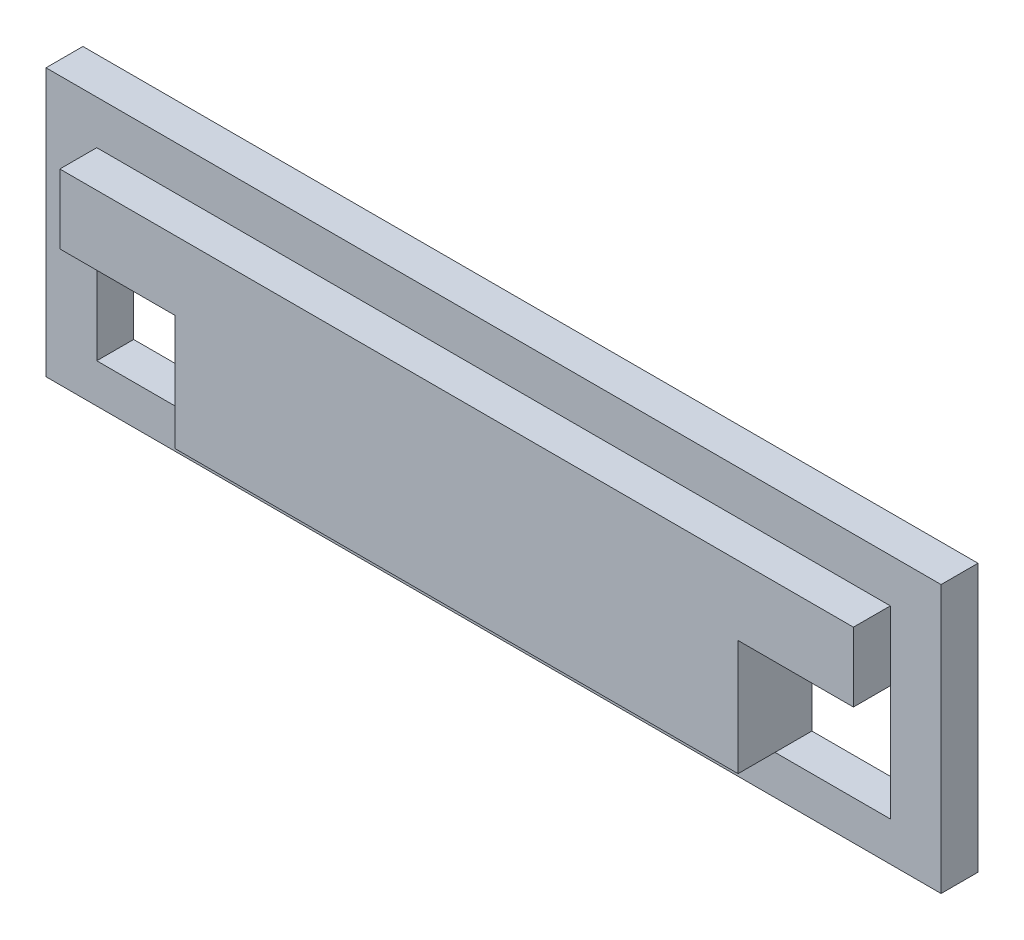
ISO-10303-21;
HEADER;
FILE_DESCRIPTION(('STEP AP214'),'2;1');
FILE_NAME('part.step','',(''),(''),'','','');
FILE_SCHEMA(('AUTOMOTIVE_DESIGN { 1 0 10303 214 1 1 1 1 }'));
ENDSEC;
DATA;
#1=APPLICATION_CONTEXT('core data for automotive mechanical design processes');
#2=APPLICATION_PROTOCOL_DEFINITION('international standard','automotive_design',2000,#1);
#3=PRODUCT_CONTEXT('',#1,'mechanical');
#4=PRODUCT('Part','Part','',(#3));
#5=PRODUCT_RELATED_PRODUCT_CATEGORY('part','',(#4));
#6=PRODUCT_DEFINITION_FORMATION('','',#4);
#7=PRODUCT_DEFINITION_CONTEXT('part definition',#1,'design');
#8=PRODUCT_DEFINITION('design','',#6,#7);
#9=PRODUCT_DEFINITION_SHAPE('','',#8);
#10=(LENGTH_UNIT() NAMED_UNIT(*) SI_UNIT(.MILLI.,.METRE.));
#11=(NAMED_UNIT(*) PLANE_ANGLE_UNIT() SI_UNIT($,.RADIAN.));
#12=(NAMED_UNIT(*) SI_UNIT($,.STERADIAN.) SOLID_ANGLE_UNIT());
#13=UNCERTAINTY_MEASURE_WITH_UNIT(LENGTH_MEASURE(1.E-05),#10,'distance_accuracy_value','');
#14=(GEOMETRIC_REPRESENTATION_CONTEXT(3) GLOBAL_UNCERTAINTY_ASSIGNED_CONTEXT((#13)) GLOBAL_UNIT_ASSIGNED_CONTEXT((#10,
#11,#12)) REPRESENTATION_CONTEXT('',''));
#15=CARTESIAN_POINT('',(0.,0.,0.));
#16=DIRECTION('',(0.,0.,1.));
#17=DIRECTION('',(1.,0.,0.));
#18=AXIS2_PLACEMENT_3D('',#15,#16,#17);
#19=CARTESIAN_POINT('',(0.,0.,0.8));
#20=DIRECTION('',(0.,0.,-1.));
#21=DIRECTION('',(-1.,0.,0.));
#22=AXIS2_PLACEMENT_3D('',#19,#20,#21);
#23=PLANE('',#22);
#24=DIRECTION('',(0.,-1.,0.));
#25=VECTOR('',#24,1.);
#26=CARTESIAN_POINT('',(0.,0.,0.8));
#27=LINE('',#26,#25);
#28=CARTESIAN_POINT('',(0.,5.8,0.8));
#29=VERTEX_POINT('',#28);
#30=CARTESIAN_POINT('',(0.,0.,0.8));
#31=VERTEX_POINT('',#30);
#32=EDGE_CURVE('E233',#29,#31,#27,.T.);
#33=ORIENTED_EDGE('',*,*,#32,.T.);
#34=DIRECTION('',(1.,0.,0.));
#35=VECTOR('',#34,1.);
#36=CARTESIAN_POINT('',(0.,0.,0.8));
#37=LINE('',#36,#35);
#38=CARTESIAN_POINT('',(19.4,0.,0.8));
#39=VERTEX_POINT('',#38);
#40=EDGE_CURVE('E236',#31,#39,#37,.T.);
#41=ORIENTED_EDGE('',*,*,#40,.T.);
#42=DIRECTION('',(0.,1.,0.));
#43=VECTOR('',#42,1.);
#44=CARTESIAN_POINT('',(19.4,0.,0.8));
#45=LINE('',#44,#43);
#46=CARTESIAN_POINT('',(19.4,5.8,0.8));
#47=VERTEX_POINT('',#46);
#48=EDGE_CURVE('E239',#39,#47,#45,.T.);
#49=ORIENTED_EDGE('',*,*,#48,.T.);
#50=DIRECTION('',(-1.,0.,0.));
#51=VECTOR('',#50,1.);
#52=CARTESIAN_POINT('',(0.,5.8,0.8));
#53=LINE('',#52,#51);
#54=EDGE_CURVE('E241',#47,#29,#53,.T.);
#55=ORIENTED_EDGE('',*,*,#54,.T.);
#56=EDGE_LOOP('',(#33,#41,#49,#55));
#57=FACE_BOUND('',#56,.T.);
#58=DIRECTION('',(0.,-1.,0.));
#59=VECTOR('',#58,1.);
#60=CARTESIAN_POINT('',(1.1,4.85,0.8));
#61=LINE('',#60,#59);
#62=CARTESIAN_POINT('',(1.1,4.85,0.8));
#63=VERTEX_POINT('',#62);
#64=CARTESIAN_POINT('',(1.1,3.35,0.800000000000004));
#65=VERTEX_POINT('',#64);
#66=EDGE_CURVE('E204',#63,#65,#61,.T.);
#67=ORIENTED_EDGE('',*,*,#66,.F.);
#68=DIRECTION('',(-1.,0.,0.));
#69=VECTOR('',#68,1.);
#70=CARTESIAN_POINT('',(1.1,4.85,0.8));
#71=LINE('',#70,#69);
#72=CARTESIAN_POINT('',(18.3,4.85,0.8));
#73=VERTEX_POINT('',#72);
#74=EDGE_CURVE('E209',#73,#63,#71,.T.);
#75=ORIENTED_EDGE('',*,*,#74,.F.);
#76=DIRECTION('',(0.,1.,0.));
#77=VECTOR('',#76,1.);
#78=CARTESIAN_POINT('',(18.3,4.85,0.8));
#79=LINE('',#78,#77);
#80=CARTESIAN_POINT('',(18.3,3.35,0.800000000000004));
#81=VERTEX_POINT('',#80);
#82=EDGE_CURVE('E222',#81,#73,#79,.T.);
#83=ORIENTED_EDGE('',*,*,#82,.F.);
#84=CARTESIAN_POINT('',(18.3,0.85,0.800000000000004));
#85=VERTEX_POINT('',#84);
#86=EDGE_CURVE('E223',#85,#81,#79,.T.);
#87=ORIENTED_EDGE('',*,*,#86,.F.);
#88=DIRECTION('',(-1.,0.,0.));
#89=VECTOR('',#88,1.);
#90=CARTESIAN_POINT('',(0.,0.85,0.8));
#91=LINE('',#90,#89);
#92=CARTESIAN_POINT('',(15.8,0.85,0.800000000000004));
#93=VERTEX_POINT('',#92);
#94=EDGE_CURVE('E202',#85,#93,#91,.T.);
#95=ORIENTED_EDGE('',*,*,#94,.T.);
#96=DIRECTION('',(1.,0.,0.));
#97=VECTOR('',#96,1.);
#98=CARTESIAN_POINT('',(1.1,0.85,0.8));
#99=LINE('',#98,#97);
#100=CARTESIAN_POINT('',(3.6,0.85,0.800000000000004));
#101=VERTEX_POINT('',#100);
#102=EDGE_CURVE('E219',#101,#93,#99,.T.);
#103=ORIENTED_EDGE('',*,*,#102,.F.);
#104=CARTESIAN_POINT('',(1.1,0.85,0.800000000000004));
#105=VERTEX_POINT('',#104);
#106=EDGE_CURVE('E220',#105,#101,#99,.T.);
#107=ORIENTED_EDGE('',*,*,#106,.F.);
#108=DIRECTION('',(0.,1.,0.));
#109=VECTOR('',#108,1.);
#110=CARTESIAN_POINT('',(1.1,0.,0.8));
#111=LINE('',#110,#109);
#112=EDGE_CURVE('E199',#105,#65,#111,.T.);
#113=ORIENTED_EDGE('',*,*,#112,.T.);
#114=EDGE_LOOP('',(#67,#75,#83,#87,#95,#103,#107,#113));
#115=FACE_BOUND('',#114,.T.);
#116=ADVANCED_FACE('F33',(#57,#115),#23,.F.);
#117=CARTESIAN_POINT('',(0.,0.,0.8));
#118=DIRECTION('',(1.,0.,0.));
#119=DIRECTION('',(0.,1.,0.));
#120=AXIS2_PLACEMENT_3D('',#117,#118,#119);
#121=PLANE('',#120);
#122=DIRECTION('',(0.,-1.,0.));
#123=VECTOR('',#122,1.);
#124=CARTESIAN_POINT('',(0.,0.,0.));
#125=LINE('',#124,#123);
#126=CARTESIAN_POINT('',(0.,5.8,0.));
#127=VERTEX_POINT('',#126);
#128=CARTESIAN_POINT('',(0.,0.,0.));
#129=VERTEX_POINT('',#128);
#130=EDGE_CURVE('E232',#127,#129,#125,.T.);
#131=ORIENTED_EDGE('',*,*,#130,.T.);
#132=DIRECTION('',(0.,0.,-1.));
#133=VECTOR('',#132,1.);
#134=CARTESIAN_POINT('',(0.,0.,0.8));
#135=LINE('',#134,#133);
#136=EDGE_CURVE('E259',#31,#129,#135,.T.);
#137=ORIENTED_EDGE('',*,*,#136,.F.);
#138=ORIENTED_EDGE('',*,*,#32,.F.);
#139=DIRECTION('',(0.,0.,-1.));
#140=VECTOR('',#139,1.);
#141=CARTESIAN_POINT('',(0.,5.8,0.8));
#142=LINE('',#141,#140);
#143=EDGE_CURVE('E243',#29,#127,#142,.T.);
#144=ORIENTED_EDGE('',*,*,#143,.T.);
#145=EDGE_LOOP('',(#131,#137,#138,#144));
#146=FACE_BOUND('',#145,.T.);
#147=ADVANCED_FACE('F35',(#146),#121,.F.);
#148=CARTESIAN_POINT('',(0.,0.,0.8));
#149=DIRECTION('',(0.,1.,0.));
#150=DIRECTION('',(0.,0.,1.));
#151=AXIS2_PLACEMENT_3D('',#148,#149,#150);
#152=PLANE('',#151);
#153=DIRECTION('',(1.,0.,0.));
#154=VECTOR('',#153,1.);
#155=CARTESIAN_POINT('',(0.,0.,0.));
#156=LINE('',#155,#154);
#157=CARTESIAN_POINT('',(19.4,0.,0.));
#158=VERTEX_POINT('',#157);
#159=EDGE_CURVE('E246',#129,#158,#156,.T.);
#160=ORIENTED_EDGE('',*,*,#159,.T.);
#161=DIRECTION('',(0.,0.,-1.));
#162=VECTOR('',#161,1.);
#163=CARTESIAN_POINT('',(19.4,0.,0.8));
#164=LINE('',#163,#162);
#165=EDGE_CURVE('E256',#39,#158,#164,.T.);
#166=ORIENTED_EDGE('',*,*,#165,.F.);
#167=ORIENTED_EDGE('',*,*,#40,.F.);
#168=ORIENTED_EDGE('',*,*,#136,.T.);
#169=EDGE_LOOP('',(#160,#166,#167,#168));
#170=FACE_BOUND('',#169,.T.);
#171=ADVANCED_FACE('F331',(#170),#152,.F.);
#172=CARTESIAN_POINT('',(19.4,0.,0.8));
#173=DIRECTION('',(-1.,0.,0.));
#174=DIRECTION('',(0.,-1.,0.));
#175=AXIS2_PLACEMENT_3D('',#172,#173,#174);
#176=PLANE('',#175);
#177=DIRECTION('',(0.,1.,0.));
#178=VECTOR('',#177,1.);
#179=CARTESIAN_POINT('',(19.4,0.,0.));
#180=LINE('',#179,#178);
#181=CARTESIAN_POINT('',(19.4,5.8,0.));
#182=VERTEX_POINT('',#181);
#183=EDGE_CURVE('E248',#158,#182,#180,.T.);
#184=ORIENTED_EDGE('',*,*,#183,.T.);
#185=DIRECTION('',(0.,0.,-1.));
#186=VECTOR('',#185,1.);
#187=CARTESIAN_POINT('',(19.4,5.8,0.8));
#188=LINE('',#187,#186);
#189=EDGE_CURVE('E253',#47,#182,#188,.T.);
#190=ORIENTED_EDGE('',*,*,#189,.F.);
#191=ORIENTED_EDGE('',*,*,#48,.F.);
#192=ORIENTED_EDGE('',*,*,#165,.T.);
#193=EDGE_LOOP('',(#184,#190,#191,#192));
#194=FACE_BOUND('',#193,.T.);
#195=ADVANCED_FACE('F328',(#194),#176,.F.);
#196=CARTESIAN_POINT('',(0.,5.8,0.8));
#197=DIRECTION('',(0.,-1.,0.));
#198=DIRECTION('',(0.,0.,-1.));
#199=AXIS2_PLACEMENT_3D('',#196,#197,#198);
#200=PLANE('',#199);
#201=DIRECTION('',(-1.,0.,0.));
#202=VECTOR('',#201,1.);
#203=CARTESIAN_POINT('',(0.,5.8,0.));
#204=LINE('',#203,#202);
#205=EDGE_CURVE('E237',#182,#127,#204,.T.);
#206=ORIENTED_EDGE('',*,*,#205,.T.);
#207=ORIENTED_EDGE('',*,*,#143,.F.);
#208=ORIENTED_EDGE('',*,*,#54,.F.);
#209=ORIENTED_EDGE('',*,*,#189,.T.);
#210=EDGE_LOOP('',(#206,#207,#208,#209));
#211=FACE_BOUND('',#210,.T.);
#212=ADVANCED_FACE('F314',(#211),#200,.F.);
#213=CARTESIAN_POINT('',(0.,0.,0.));
#214=DIRECTION('',(0.,0.,-1.));
#215=DIRECTION('',(-1.,0.,0.));
#216=AXIS2_PLACEMENT_3D('',#213,#214,#215);
#217=PLANE('',#216);
#218=DIRECTION('',(0.,-1.,0.));
#219=VECTOR('',#218,1.);
#220=CARTESIAN_POINT('',(18.3,0.85,0.));
#221=LINE('',#220,#219);
#222=CARTESIAN_POINT('',(18.3,3.35,0.));
#223=VERTEX_POINT('',#222);
#224=CARTESIAN_POINT('',(18.3,0.85,0.));
#225=VERTEX_POINT('',#224);
#226=EDGE_CURVE('E48',#223,#225,#221,.T.);
#227=ORIENTED_EDGE('',*,*,#226,.F.);
#228=DIRECTION('',(1.,0.,0.));
#229=VECTOR('',#228,1.);
#230=CARTESIAN_POINT('',(18.3,3.35,0.));
#231=LINE('',#230,#229);
#232=CARTESIAN_POINT('',(15.8,3.35,0.));
#233=VERTEX_POINT('',#232);
#234=EDGE_CURVE('E168',#233,#223,#231,.T.);
#235=ORIENTED_EDGE('',*,*,#234,.F.);
#236=DIRECTION('',(0.,1.,0.));
#237=VECTOR('',#236,1.);
#238=CARTESIAN_POINT('',(15.8,0.85,0.));
#239=LINE('',#238,#237);
#240=CARTESIAN_POINT('',(15.8,0.85,0.));
#241=VERTEX_POINT('',#240);
#242=EDGE_CURVE('E152',#241,#233,#239,.T.);
#243=ORIENTED_EDGE('',*,*,#242,.F.);
#244=DIRECTION('',(-1.,0.,0.));
#245=VECTOR('',#244,1.);
#246=CARTESIAN_POINT('',(18.3,0.85,0.));
#247=LINE('',#246,#245);
#248=EDGE_CURVE('E161',#225,#241,#247,.T.);
#249=ORIENTED_EDGE('',*,*,#248,.F.);
#250=EDGE_LOOP('',(#227,#235,#243,#249));
#251=FACE_BOUND('',#250,.T.);
#252=DIRECTION('',(0.,-1.,0.));
#253=VECTOR('',#252,1.);
#254=CARTESIAN_POINT('',(3.6,3.35,0.));
#255=LINE('',#254,#253);
#256=CARTESIAN_POINT('',(3.6,3.35,0.));
#257=VERTEX_POINT('',#256);
#258=CARTESIAN_POINT('',(3.6,0.85,0.));
#259=VERTEX_POINT('',#258);
#260=EDGE_CURVE('E56',#257,#259,#255,.T.);
#261=ORIENTED_EDGE('',*,*,#260,.F.);
#262=DIRECTION('',(1.,0.,0.));
#263=VECTOR('',#262,1.);
#264=CARTESIAN_POINT('',(3.6,3.35,0.));
#265=LINE('',#264,#263);
#266=CARTESIAN_POINT('',(1.1,3.35,0.));
#267=VERTEX_POINT('',#266);
#268=EDGE_CURVE('E186',#267,#257,#265,.T.);
#269=ORIENTED_EDGE('',*,*,#268,.F.);
#270=DIRECTION('',(0.,1.,0.));
#271=VECTOR('',#270,1.);
#272=CARTESIAN_POINT('',(1.1,3.35,0.));
#273=LINE('',#272,#271);
#274=CARTESIAN_POINT('',(1.1,0.85,0.));
#275=VERTEX_POINT('',#274);
#276=EDGE_CURVE('E183',#275,#267,#273,.T.);
#277=ORIENTED_EDGE('',*,*,#276,.F.);
#278=DIRECTION('',(-1.,0.,0.));
#279=VECTOR('',#278,1.);
#280=CARTESIAN_POINT('',(3.6,0.85,0.));
#281=LINE('',#280,#279);
#282=EDGE_CURVE('E180',#259,#275,#281,.T.);
#283=ORIENTED_EDGE('',*,*,#282,.F.);
#284=EDGE_LOOP('',(#261,#269,#277,#283));
#285=FACE_BOUND('',#284,.T.);
#286=ORIENTED_EDGE('',*,*,#130,.F.);
#287=ORIENTED_EDGE('',*,*,#205,.F.);
#288=ORIENTED_EDGE('',*,*,#183,.F.);
#289=ORIENTED_EDGE('',*,*,#159,.F.);
#290=EDGE_LOOP('',(#286,#287,#288,#289));
#291=FACE_BOUND('',#290,.T.);
#292=ADVANCED_FACE('F165',(#251,#285,#291),#217,.T.);
#293=CARTESIAN_POINT('',(1.1,4.85,1.6));
#294=DIRECTION('',(1.,0.,0.));
#295=DIRECTION('',(0.,1.,0.));
#296=AXIS2_PLACEMENT_3D('',#293,#294,#295);
#297=PLANE('',#296);
#298=ORIENTED_EDGE('',*,*,#66,.T.);
#299=DIRECTION('',(0.,0.,-1.));
#300=VECTOR('',#299,1.);
#301=CARTESIAN_POINT('',(1.1,3.35,10.8));
#302=LINE('',#301,#300);
#303=CARTESIAN_POINT('',(1.1,3.35,1.6));
#304=VERTEX_POINT('',#303);
#305=EDGE_CURVE('E192',#304,#65,#302,.T.);
#306=ORIENTED_EDGE('',*,*,#305,.F.);
#307=DIRECTION('',(0.,-1.,0.));
#308=VECTOR('',#307,1.);
#309=CARTESIAN_POINT('',(1.1,4.85,1.6));
#310=LINE('',#309,#308);
#311=CARTESIAN_POINT('',(1.1,4.85,1.6));
#312=VERTEX_POINT('',#311);
#313=EDGE_CURVE('E205',#312,#304,#310,.T.);
#314=ORIENTED_EDGE('',*,*,#313,.F.);
#315=DIRECTION('',(0.,0.,-1.));
#316=VECTOR('',#315,1.);
#317=CARTESIAN_POINT('',(1.1,4.85,1.6));
#318=LINE('',#317,#316);
#319=EDGE_CURVE('E216',#312,#63,#318,.T.);
#320=ORIENTED_EDGE('',*,*,#319,.T.);
#321=EDGE_LOOP('',(#298,#306,#314,#320));
#322=FACE_BOUND('',#321,.T.);
#323=ADVANCED_FACE('F300',(#322),#297,.F.);
#324=CARTESIAN_POINT('',(1.1,0.85,1.6));
#325=DIRECTION('',(0.,1.,0.));
#326=DIRECTION('',(0.,0.,1.));
#327=AXIS2_PLACEMENT_3D('',#324,#325,#326);
#328=PLANE('',#327);
#329=ORIENTED_EDGE('',*,*,#102,.T.);
#330=DIRECTION('',(0.,0.,-1.));
#331=VECTOR('',#330,1.);
#332=CARTESIAN_POINT('',(15.8,0.85,10.8));
#333=LINE('',#332,#331);
#334=CARTESIAN_POINT('',(15.8,0.85,1.6));
#335=VERTEX_POINT('',#334);
#336=EDGE_CURVE('E155',#335,#93,#333,.T.);
#337=ORIENTED_EDGE('',*,*,#336,.F.);
#338=DIRECTION('',(1.,0.,0.));
#339=VECTOR('',#338,1.);
#340=CARTESIAN_POINT('',(1.1,0.85,1.6));
#341=LINE('',#340,#339);
#342=CARTESIAN_POINT('',(3.6,0.85,1.6));
#343=VERTEX_POINT('',#342);
#344=EDGE_CURVE('E208',#343,#335,#341,.T.);
#345=ORIENTED_EDGE('',*,*,#344,.F.);
#346=DIRECTION('',(0.,0.,-1.));
#347=VECTOR('',#346,1.);
#348=CARTESIAN_POINT('',(3.6,0.85,10.8));
#349=LINE('',#348,#347);
#350=EDGE_CURVE('E197',#343,#101,#349,.T.);
#351=ORIENTED_EDGE('',*,*,#350,.T.);
#352=EDGE_LOOP('',(#329,#337,#345,#351));
#353=FACE_BOUND('',#352,.T.);
#354=ADVANCED_FACE('F272',(#353),#328,.F.);
#355=CARTESIAN_POINT('',(18.3,4.85,1.6));
#356=DIRECTION('',(-1.,0.,0.));
#357=DIRECTION('',(0.,0.,1.));
#358=AXIS2_PLACEMENT_3D('',#355,#356,#357);
#359=PLANE('',#358);
#360=DIRECTION('',(0.,1.,0.));
#361=VECTOR('',#360,1.);
#362=CARTESIAN_POINT('',(18.3,4.85,1.6));
#363=LINE('',#362,#361);
#364=CARTESIAN_POINT('',(18.3,3.35,1.6));
#365=VERTEX_POINT('',#364);
#366=CARTESIAN_POINT('',(18.3,4.85,1.6));
#367=VERTEX_POINT('',#366);
#368=EDGE_CURVE('E212',#365,#367,#363,.T.);
#369=ORIENTED_EDGE('',*,*,#368,.F.);
#370=DIRECTION('',(0.,0.,-1.));
#371=VECTOR('',#370,1.);
#372=CARTESIAN_POINT('',(18.3,3.35,10.8));
#373=LINE('',#372,#371);
#374=EDGE_CURVE('E175',#365,#81,#373,.T.);
#375=ORIENTED_EDGE('',*,*,#374,.T.);
#376=ORIENTED_EDGE('',*,*,#82,.T.);
#377=DIRECTION('',(0.,0.,-1.));
#378=VECTOR('',#377,1.);
#379=CARTESIAN_POINT('',(18.3,4.85,1.6));
#380=LINE('',#379,#378);
#381=EDGE_CURVE('E229',#367,#73,#380,.T.);
#382=ORIENTED_EDGE('',*,*,#381,.F.);
#383=EDGE_LOOP('',(#369,#375,#376,#382));
#384=FACE_BOUND('',#383,.T.);
#385=ADVANCED_FACE('F290',(#384),#359,.F.);
#386=CARTESIAN_POINT('',(1.1,4.85,1.6));
#387=DIRECTION('',(0.,-1.,0.));
#388=DIRECTION('',(0.,0.,-1.));
#389=AXIS2_PLACEMENT_3D('',#386,#387,#388);
#390=PLANE('',#389);
#391=ORIENTED_EDGE('',*,*,#74,.T.);
#392=ORIENTED_EDGE('',*,*,#319,.F.);
#393=DIRECTION('',(-1.,0.,0.));
#394=VECTOR('',#393,1.);
#395=CARTESIAN_POINT('',(1.1,4.85,1.6));
#396=LINE('',#395,#394);
#397=EDGE_CURVE('E214',#367,#312,#396,.T.);
#398=ORIENTED_EDGE('',*,*,#397,.F.);
#399=ORIENTED_EDGE('',*,*,#381,.T.);
#400=EDGE_LOOP('',(#391,#392,#398,#399));
#401=FACE_BOUND('',#400,.T.);
#402=ADVANCED_FACE('F296',(#401),#390,.F.);
#403=CARTESIAN_POINT('',(0.,0.,1.6));
#404=DIRECTION('',(0.,0.,1.));
#405=DIRECTION('',(1.,0.,0.));
#406=AXIS2_PLACEMENT_3D('',#403,#404,#405);
#407=PLANE('',#406);
#408=DIRECTION('',(-1.,0.,0.));
#409=VECTOR('',#408,1.);
#410=CARTESIAN_POINT('',(0.,3.35,1.6));
#411=LINE('',#410,#409);
#412=CARTESIAN_POINT('',(15.8,3.35,1.6));
#413=VERTEX_POINT('',#412);
#414=EDGE_CURVE('E11',#365,#413,#411,.T.);
#415=ORIENTED_EDGE('',*,*,#414,.F.);
#416=ORIENTED_EDGE('',*,*,#368,.T.);
#417=ORIENTED_EDGE('',*,*,#397,.T.);
#418=ORIENTED_EDGE('',*,*,#313,.T.);
#419=DIRECTION('',(-1.,0.,0.));
#420=VECTOR('',#419,1.);
#421=CARTESIAN_POINT('',(0.,3.35,1.6));
#422=LINE('',#421,#420);
#423=CARTESIAN_POINT('',(3.6,3.35,1.6));
#424=VERTEX_POINT('',#423);
#425=EDGE_CURVE('E262',#424,#304,#422,.T.);
#426=ORIENTED_EDGE('',*,*,#425,.F.);
#427=DIRECTION('',(0.,1.,0.));
#428=VECTOR('',#427,1.);
#429=CARTESIAN_POINT('',(3.6,0.,1.6));
#430=LINE('',#429,#428);
#431=EDGE_CURVE('E264',#343,#424,#430,.T.);
#432=ORIENTED_EDGE('',*,*,#431,.F.);
#433=ORIENTED_EDGE('',*,*,#344,.T.);
#434=DIRECTION('',(0.,-1.,0.));
#435=VECTOR('',#434,1.);
#436=CARTESIAN_POINT('',(15.8,0.,1.6));
#437=LINE('',#436,#435);
#438=EDGE_CURVE('E41',#413,#335,#437,.T.);
#439=ORIENTED_EDGE('',*,*,#438,.F.);
#440=EDGE_LOOP('',(#415,#416,#417,#418,#426,#432,#433,#439));
#441=FACE_BOUND('',#440,.T.);
#442=ADVANCED_FACE('F276',(#441),#407,.T.);
#443=CARTESIAN_POINT('',(1.1,3.35,10.8));
#444=DIRECTION('',(-1.,0.,0.));
#445=DIRECTION('',(0.,-1.,0.));
#446=AXIS2_PLACEMENT_3D('',#443,#444,#445);
#447=PLANE('',#446);
#448=DIRECTION('',(0.,0.,-1.));
#449=VECTOR('',#448,1.);
#450=CARTESIAN_POINT('',(1.1,0.85,10.8));
#451=LINE('',#450,#449);
#452=EDGE_CURVE('E195',#105,#275,#451,.T.);
#453=ORIENTED_EDGE('',*,*,#452,.T.);
#454=ORIENTED_EDGE('',*,*,#276,.T.);
#455=EDGE_CURVE('E193',#65,#267,#302,.T.);
#456=ORIENTED_EDGE('',*,*,#455,.F.);
#457=ORIENTED_EDGE('',*,*,#112,.F.);
#458=EDGE_LOOP('',(#453,#454,#456,#457));
#459=FACE_BOUND('',#458,.T.);
#460=ADVANCED_FACE('F306',(#459),#447,.F.);
#461=CARTESIAN_POINT('',(3.6,0.85,10.8));
#462=DIRECTION('',(0.,-1.,0.));
#463=DIRECTION('',(0.,0.,-1.));
#464=AXIS2_PLACEMENT_3D('',#461,#462,#463);
#465=PLANE('',#464);
#466=EDGE_CURVE('E189',#101,#259,#349,.T.);
#467=ORIENTED_EDGE('',*,*,#466,.T.);
#468=ORIENTED_EDGE('',*,*,#282,.T.);
#469=ORIENTED_EDGE('',*,*,#452,.F.);
#470=ORIENTED_EDGE('',*,*,#106,.T.);
#471=EDGE_LOOP('',(#467,#468,#469,#470));
#472=FACE_BOUND('',#471,.T.);
#473=ADVANCED_FACE('F308',(#472),#465,.F.);
#474=CARTESIAN_POINT('',(3.6,3.35,10.8));
#475=DIRECTION('',(1.,0.,0.));
#476=DIRECTION('',(0.,1.,0.));
#477=AXIS2_PLACEMENT_3D('',#474,#475,#476);
#478=PLANE('',#477);
#479=ORIENTED_EDGE('',*,*,#431,.T.);
#480=DIRECTION('',(0.,0.,-1.));
#481=VECTOR('',#480,1.);
#482=CARTESIAN_POINT('',(3.6,3.35,10.8));
#483=LINE('',#482,#481);
#484=EDGE_CURVE('E190',#424,#257,#483,.T.);
#485=ORIENTED_EDGE('',*,*,#484,.T.);
#486=ORIENTED_EDGE('',*,*,#260,.T.);
#487=ORIENTED_EDGE('',*,*,#466,.F.);
#488=ORIENTED_EDGE('',*,*,#350,.F.);
#489=EDGE_LOOP('',(#479,#485,#486,#487,#488));
#490=FACE_BOUND('',#489,.T.);
#491=ADVANCED_FACE('F278',(#490),#478,.F.);
#492=CARTESIAN_POINT('',(3.6,3.35,10.8));
#493=DIRECTION('',(0.,1.,0.));
#494=DIRECTION('',(0.,0.,1.));
#495=AXIS2_PLACEMENT_3D('',#492,#493,#494);
#496=PLANE('',#495);
#497=ORIENTED_EDGE('',*,*,#425,.T.);
#498=ORIENTED_EDGE('',*,*,#305,.T.);
#499=ORIENTED_EDGE('',*,*,#455,.T.);
#500=ORIENTED_EDGE('',*,*,#268,.T.);
#501=ORIENTED_EDGE('',*,*,#484,.F.);
#502=EDGE_LOOP('',(#497,#498,#499,#500,#501));
#503=FACE_BOUND('',#502,.T.);
#504=ADVANCED_FACE('F303',(#503),#496,.F.);
#505=CARTESIAN_POINT('',(18.3,0.85,10.8));
#506=DIRECTION('',(1.,0.,0.));
#507=DIRECTION('',(0.,0.,-1.));
#508=AXIS2_PLACEMENT_3D('',#505,#506,#507);
#509=PLANE('',#508);
#510=EDGE_CURVE('E173',#81,#223,#373,.T.);
#511=ORIENTED_EDGE('',*,*,#510,.T.);
#512=ORIENTED_EDGE('',*,*,#226,.T.);
#513=DIRECTION('',(0.,0.,-1.));
#514=VECTOR('',#513,1.);
#515=CARTESIAN_POINT('',(18.3,0.85,10.8));
#516=LINE('',#515,#514);
#517=EDGE_CURVE('E158',#85,#225,#516,.T.);
#518=ORIENTED_EDGE('',*,*,#517,.F.);
#519=ORIENTED_EDGE('',*,*,#86,.T.);
#520=EDGE_LOOP('',(#511,#512,#518,#519));
#521=FACE_BOUND('',#520,.T.);
#522=ADVANCED_FACE('F283',(#521),#509,.F.);
#523=CARTESIAN_POINT('',(18.3,0.85,10.8));
#524=DIRECTION('',(0.,-1.,0.));
#525=DIRECTION('',(0.,0.,-1.));
#526=AXIS2_PLACEMENT_3D('',#523,#524,#525);
#527=PLANE('',#526);
#528=ORIENTED_EDGE('',*,*,#517,.T.);
#529=ORIENTED_EDGE('',*,*,#248,.T.);
#530=EDGE_CURVE('E148',#93,#241,#333,.T.);
#531=ORIENTED_EDGE('',*,*,#530,.F.);
#532=ORIENTED_EDGE('',*,*,#94,.F.);
#533=EDGE_LOOP('',(#528,#529,#531,#532));
#534=FACE_BOUND('',#533,.T.);
#535=ADVANCED_FACE('F162',(#534),#527,.F.);
#536=CARTESIAN_POINT('',(18.3,3.35,10.8));
#537=DIRECTION('',(0.,1.,0.));
#538=DIRECTION('',(0.,0.,1.));
#539=AXIS2_PLACEMENT_3D('',#536,#537,#538);
#540=PLANE('',#539);
#541=ORIENTED_EDGE('',*,*,#414,.T.);
#542=DIRECTION('',(0.,0.,-1.));
#543=VECTOR('',#542,1.);
#544=CARTESIAN_POINT('',(15.8,3.35,10.8));
#545=LINE('',#544,#543);
#546=EDGE_CURVE('E176',#413,#233,#545,.T.);
#547=ORIENTED_EDGE('',*,*,#546,.T.);
#548=ORIENTED_EDGE('',*,*,#234,.T.);
#549=ORIENTED_EDGE('',*,*,#510,.F.);
#550=ORIENTED_EDGE('',*,*,#374,.F.);
#551=EDGE_LOOP('',(#541,#547,#548,#549,#550));
#552=FACE_BOUND('',#551,.T.);
#553=ADVANCED_FACE('F287',(#552),#540,.F.);
#554=CARTESIAN_POINT('',(15.8,0.85,10.8));
#555=DIRECTION('',(-1.,0.,0.));
#556=DIRECTION('',(0.,0.,1.));
#557=AXIS2_PLACEMENT_3D('',#554,#555,#556);
#558=PLANE('',#557);
#559=ORIENTED_EDGE('',*,*,#438,.T.);
#560=ORIENTED_EDGE('',*,*,#336,.T.);
#561=ORIENTED_EDGE('',*,*,#530,.T.);
#562=ORIENTED_EDGE('',*,*,#242,.T.);
#563=ORIENTED_EDGE('',*,*,#546,.F.);
#564=EDGE_LOOP('',(#559,#560,#561,#562,#563));
#565=FACE_BOUND('',#564,.T.);
#566=ADVANCED_FACE('F150',(#565),#558,.F.);
#567=CLOSED_SHELL('',(#116,#147,#171,#195,#212,#292,#323,#354,#385,#402,#442,#460,#473,#491,
#504,#522,#535,#553,#566));
#568=MANIFOLD_SOLID_BREP('B2',#567);
#569=ADVANCED_BREP_SHAPE_REPRESENTATION('',(#18,#568),#14);
#570=SHAPE_DEFINITION_REPRESENTATION(#9,#569);
ENDSEC;
END-ISO-10303-21;
